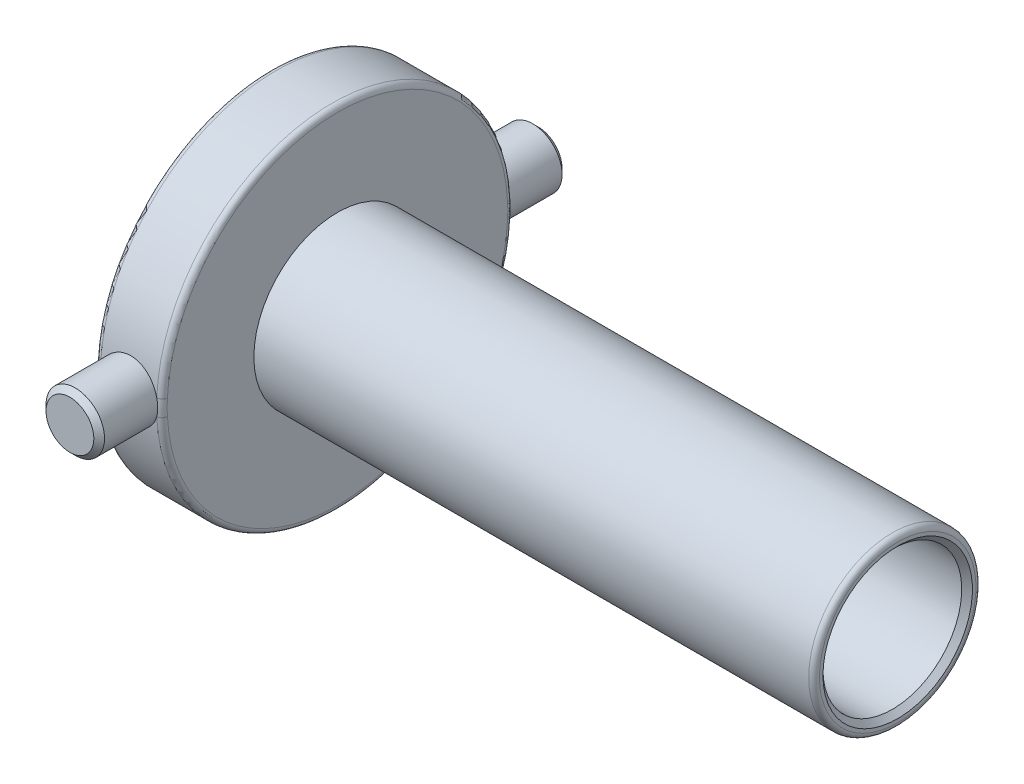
from build123d import *

# Parameters (mm, degrees)
SKETCH3_R           = 2.2225
BOSS_EXTRUDE1_DEPTH = 17.78
FILLET1_R           = 0.4064
CHAMFER1_SIZE       = 0.4064


with BuildPart() as part:
    # Sketch2 → Revolve1 (revolve)
    with BuildSketch(Plane.XY, mode=Mode.PRIVATE) as revolve1_sk:
        Polygon((5.08, 5.2705), (47.625, 5.2705), (47.625, 6.35), (5.08, 6.35), (5.08, 13.335), (0, 13.335), (0, 0), (5.08, 0), align=None)
    revolve(revolve1_sk.sketch.rotate(Axis((0, 0, 0), (1, 0, 0)), 90), axis=Axis((0, 0, 0), (1, 0, 0)))

    # Sketch3 → Boss-Extrude1 (add, symmetric)
    with BuildSketch(Plane.XY):
        with Locations(Location((2.54, 0, 0), (0, 0, 180))):
            Circle(SKETCH3_R)
    extrude(amount=BOSS_EXTRUDE1_DEPTH, both=True)

    # Fillet1
    fillet1_edges = [part.edges().sort_by_distance(p)[0] for p in [
        (47.625, 0, -6.35),
        (5.08, 0, -13.335),
        (0, 0, -13.335),
    ]]
    fillet(fillet1_edges, radius=FILLET1_R)

    # Chamfer1
    chamfer1_edges = [part.edges().sort_by_distance(p)[0] for p in [
        (4.7625, 0, -17.78),
        (4.7625, 0, 17.78),
        (47.625, 0, -5.2705),
    ]]
    chamfer(chamfer1_edges, length=CHAMFER1_SIZE)


solid = part.part
